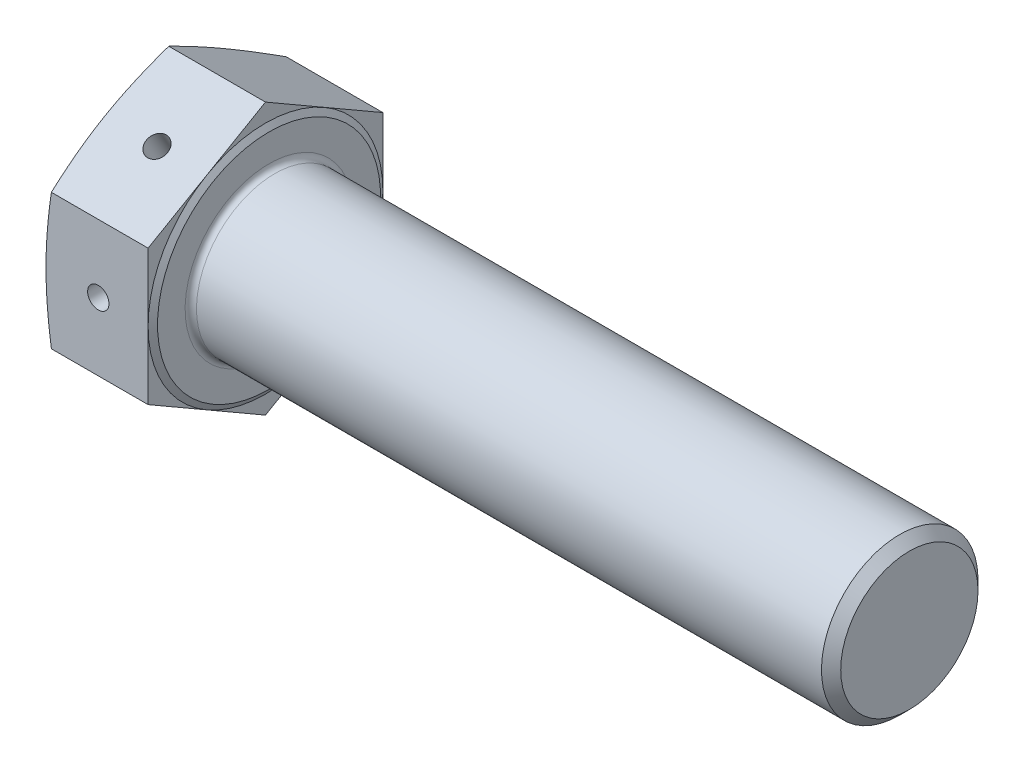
from build123d import *

# Parameters (mm, degrees)
BASEHEAD_DEPTH    = 14.35
SKETCH3_R         = 11
BASEBODY_DEPTH    = 90
CHAMFER1_SIZE     = 1.353
HEADFILLET_R      = 0.8
SKETCH5_R         = 1.5
HOLE_DEPTH        = 108.836786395
CIRPATTERN1_COUNT = 2
CIRPATTERN1_ANGLE = 60


with BuildPart() as part:
    # Sketch-BaseHead → BaseHead (new body)
    with BuildSketch(Plane(origin=(0, 0, 0), x_dir=(0, 0, -1), z_dir=(1, 0, 0))):
        Polygon((0, -19.052558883), (16.5, -9.526279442), (16.5, 9.526279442), (0, 19.052558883), (-16.5, 9.526279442), (-16.5, -9.526279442), align=None)
    extrude(amount=BASEHEAD_DEPTH)

    # Sketch4 → HeadChamfer (revolve, cut)
    with BuildSketch(Plane(origin=(-0.264637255, -5.916896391, 0), x_dir=(0, 1, 0), z_dir=(0, 0, 1))):
        Polygon((24.969455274, -0.264637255), (22.416896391, -0.264637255), (24.969455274, -1.020739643), align=None)
    revolve(axis=Axis((-4.001564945, 0, 0), (1, 0, 0)), mode=Mode.SUBTRACT)

    # Sketch2 → Revolve1 (revolve)
    with BuildSketch(Plane(origin=(0, 0, 0), x_dir=(1, 0, 0), z_dir=(0, 1, 0)), mode=Mode.PRIVATE) as revolve1_sk:
        Polygon((14.35, 0), (14.85, 0), (14.85, 15.675), (14.35, 16.5), align=None)
    revolve(revolve1_sk.sketch.rotate(Axis((-4.001564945, 0, 0), (1, 0, 0)), 270), axis=Axis((-4.001564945, 0, 0), (1, 0, 0)))

    # Sketch3 → BaseBody (add)
    with BuildSketch(Plane(origin=(14.85, 0, 0), x_dir=(0, 0, -1), z_dir=(1, 0, 0))):
        with Locations(Location((0, 0, 0), (0, 0, 270))):
            Circle(SKETCH3_R)
    extrude(amount=BASEBODY_DEPTH)

    # Chamfer1
    chamfer1_edges = [part.edges().sort_by_distance(p)[0] for p in [
        (104.85, 11, 0),
    ]]
    chamfer(chamfer1_edges, length=CHAMFER1_SIZE)

    # HeadFillet
    headfillet_edges = [part.edges().sort_by_distance(p)[0] for p in [
        (14.85, 11, 0),
    ]]
    fillet(headfillet_edges, radius=HEADFILLET_R)

    # Sketch5 → Hole (cut, symmetric)
    with BuildSketch(Plane.XY):
        with Locations((7.35, 0)):
            Circle(SKETCH5_R)
    hole = extrude(amount=HOLE_DEPTH, both=True, mode=Mode.SUBTRACT)

    # CirPattern1: Hole ×2 about axis
    cirpattern1_axis = Axis((104.85, 0, 0), (-1, 0, 0))
    for i in range(1, CIRPATTERN1_COUNT):
        add(hole.rotate(cirpattern1_axis, i * CIRPATTERN1_ANGLE / (CIRPATTERN1_COUNT - 1)), mode=Mode.SUBTRACT)


solid = part.part
